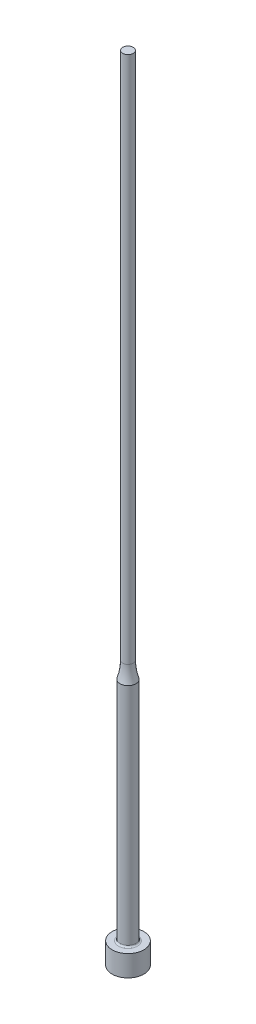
from build123d import *


with BuildPart() as part:
    # Sketch1 → Revolve1 (revolve)
    with BuildSketch(Plane.XY, mode=Mode.PRIVATE) as revolve1_sk:
        with BuildLine():
            Line((0, 0), (3, 0))
            Line((3, 0), (3, 4))
            Line((3, 4), (1.8, 4))
            ThreePointArc((1.8, 4), (1.587867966, 4.087867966), (1.5, 4.3))
            Line((1.5, 4.3), (1.5, 46.877501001))
            ThreePointArc((1.5, 46.877501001), (1.125791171, 48.41886117), (1, 50))
            Line((1, 50), (1, 150))
            Line((1, 150), (0, 150))
            Line((0, 150), (0, 0))
        make_face()
    revolve(revolve1_sk.sketch.rotate(Axis((0, 150, 0), (0, -1, 0)), 180), axis=Axis((0, 150, 0), (0, -1, 0)))


solid = part.part
